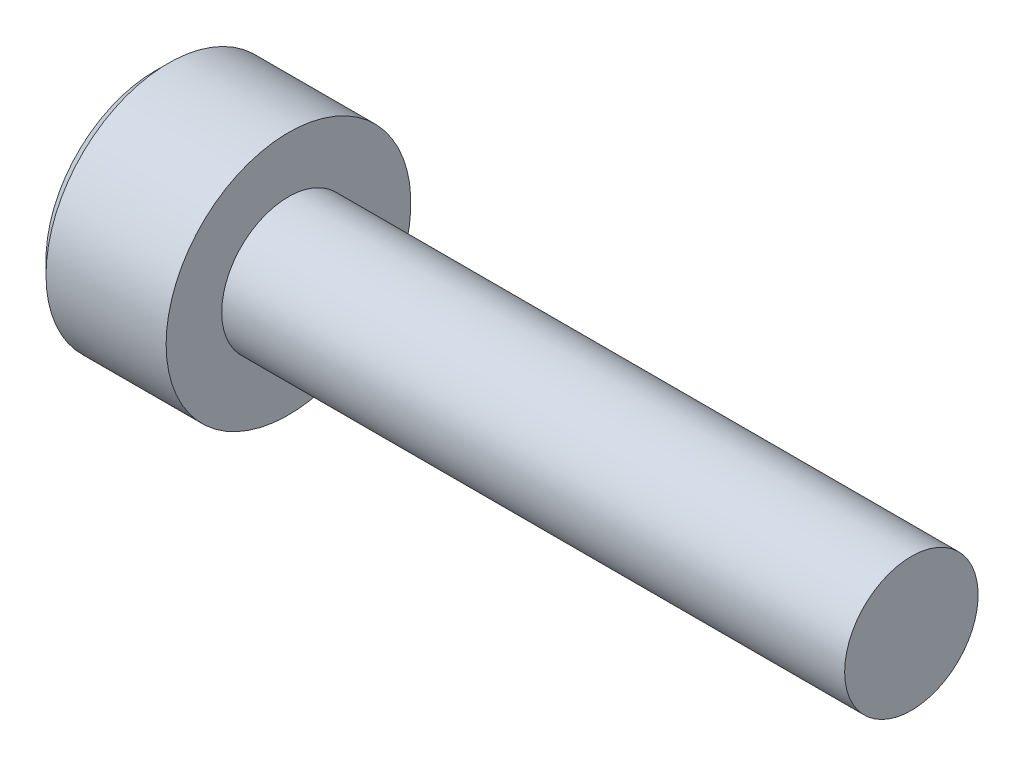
from build123d import *

# Parameters (mm, degrees)
CHAMFER1_SIZE      = 0.3
CUT_EXTRUDE1_DEPTH = 1.3


with BuildPart() as part:
    # Sketch1 → Revolve1 (revolve)
    with BuildSketch(Plane.XY, mode=Mode.PRIVATE) as revolve1_sk:
        Polygon((-3, 0), (14, 0), (14, 1.5), (0, 1.5), (0, 2.75), (-3, 2.75), align=None)
    revolve(revolve1_sk.sketch.rotate(Axis((-3, 0, 0), (1, 0, 0)), 90), axis=Axis((-3, 0, 0), (1, 0, 0)))

    # Chamfer1
    chamfer1_edges = [part.edges().sort_by_distance(p)[0] for p in [
        (-3, 0, -2.75),
    ]]
    chamfer(chamfer1_edges, length=CHAMFER1_SIZE)

    # Sketch2 → Cut-Revolve1 (revolve, cut)
    with BuildSketch(Plane.XY, mode=Mode.PRIVATE) as cut_revolve1_sk:
        Polygon((-0.948924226, 0), (-1.7, 1.25), (-3, 1.25), (-3, 0), align=None)
    revolve(cut_revolve1_sk.sketch.rotate(Axis((-3, 0, 0), (1, 0, 0)), 180), axis=Axis((-3, 0, 0), (1, 0, 0)), mode=Mode.SUBTRACT)

    # Sketch3 → Cut-Extrude1 (cut)
    with BuildSketch(Plane.ZY.offset(3)):
        Polygon((0, -1.443375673), (1.25, -0.721687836), (1.25, 0.721687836), (0, 1.443375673), (-1.25, 0.721687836), (-1.25, -0.721687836), align=None)
    extrude(amount=-CUT_EXTRUDE1_DEPTH, mode=Mode.SUBTRACT)


solid = part.part
